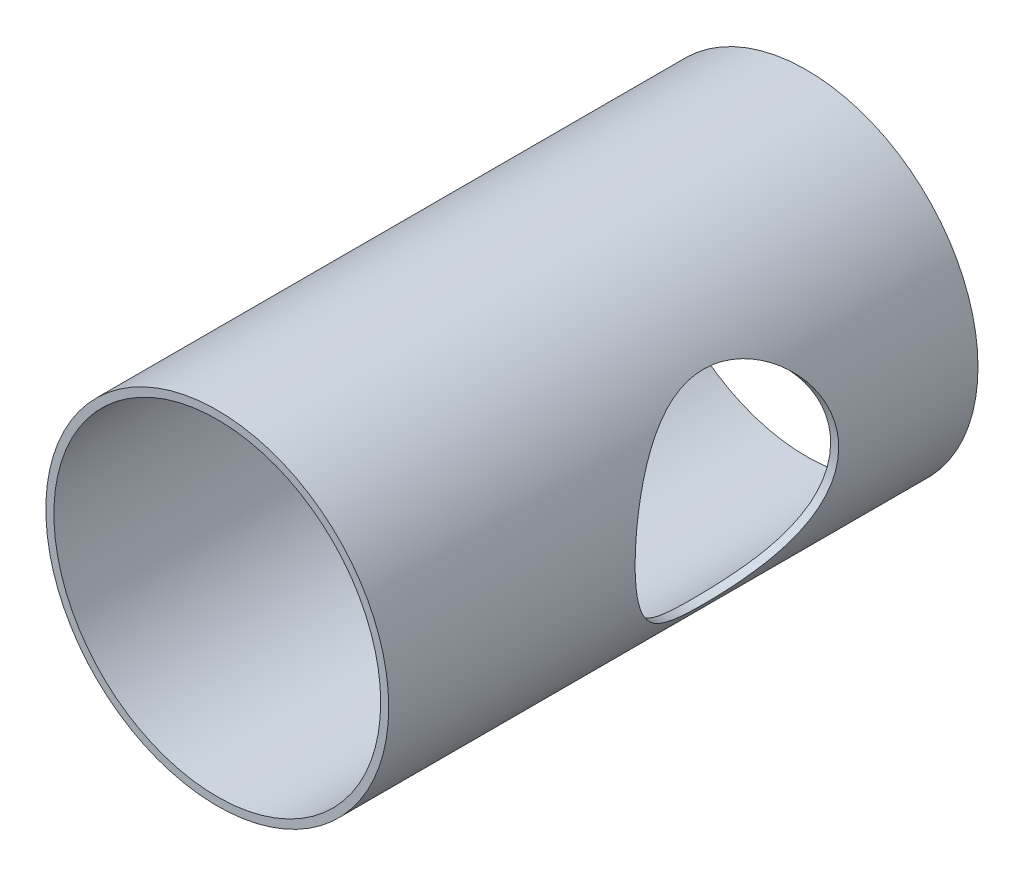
ISO-10303-21;
HEADER;
FILE_DESCRIPTION(('STEP AP214'),'2;1');
FILE_NAME('part.step','',(''),(''),'','','');
FILE_SCHEMA(('AUTOMOTIVE_DESIGN { 1 0 10303 214 1 1 1 1 }'));
ENDSEC;
DATA;
#1=APPLICATION_CONTEXT('core data for automotive mechanical design processes');
#2=APPLICATION_PROTOCOL_DEFINITION('international standard','automotive_design',2000,#1);
#3=PRODUCT_CONTEXT('',#1,'mechanical');
#4=PRODUCT('Part','Part','',(#3));
#5=PRODUCT_RELATED_PRODUCT_CATEGORY('part','',(#4));
#6=PRODUCT_DEFINITION_FORMATION('','',#4);
#7=PRODUCT_DEFINITION_CONTEXT('part definition',#1,'design');
#8=PRODUCT_DEFINITION('design','',#6,#7);
#9=PRODUCT_DEFINITION_SHAPE('','',#8);
#10=(LENGTH_UNIT() NAMED_UNIT(*) SI_UNIT(.MILLI.,.METRE.));
#11=(NAMED_UNIT(*) PLANE_ANGLE_UNIT() SI_UNIT($,.RADIAN.));
#12=(NAMED_UNIT(*) SI_UNIT($,.STERADIAN.) SOLID_ANGLE_UNIT());
#13=UNCERTAINTY_MEASURE_WITH_UNIT(LENGTH_MEASURE(1.E-05),#10,'distance_accuracy_value','');
#14=(GEOMETRIC_REPRESENTATION_CONTEXT(3) GLOBAL_UNCERTAINTY_ASSIGNED_CONTEXT((#13)) GLOBAL_UNIT_ASSIGNED_CONTEXT((#10,
#11,#12)) REPRESENTATION_CONTEXT('',''));
#15=CARTESIAN_POINT('',(0.,0.,0.));
#16=DIRECTION('',(0.,0.,1.));
#17=DIRECTION('',(1.,0.,0.));
#18=AXIS2_PLACEMENT_3D('',#15,#16,#17);
#19=CARTESIAN_POINT('',(0.,0.,220.));
#20=DIRECTION('',(0.,0.,1.));
#21=DIRECTION('',(1.,0.,0.));
#22=AXIS2_PLACEMENT_3D('',#19,#20,#21);
#23=PLANE('',#22);
#24=CARTESIAN_POINT('',(0.,0.,220.));
#25=DIRECTION('',(0.,0.,1.));
#26=DIRECTION('',(1.,0.,0.));
#27=AXIS2_PLACEMENT_3D('',#24,#25,#26);
#28=CIRCLE('',#27,64.);
#29=CARTESIAN_POINT('',(64.,0.,220.));
#30=VERTEX_POINT('',#29);
#31=EDGE_CURVE('E10',#30,#30,#28,.T.);
#32=ORIENTED_EDGE('',*,*,#31,.T.);
#33=EDGE_LOOP('',(#32));
#34=FACE_BOUND('',#33,.T.);
#35=CARTESIAN_POINT('',(0.,0.,220.));
#36=DIRECTION('',(0.,0.,1.));
#37=DIRECTION('',(1.,0.,0.));
#38=AXIS2_PLACEMENT_3D('',#35,#36,#37);
#39=CIRCLE('',#38,61.);
#40=CARTESIAN_POINT('',(61.,0.,220.));
#41=VERTEX_POINT('',#40);
#42=EDGE_CURVE('E48',#41,#41,#39,.T.);
#43=ORIENTED_EDGE('',*,*,#42,.F.);
#44=EDGE_LOOP('',(#43));
#45=FACE_BOUND('',#44,.T.);
#46=ADVANCED_FACE('F30',(#34,#45),#23,.T.);
#47=CARTESIAN_POINT('',(0.,0.,0.));
#48=DIRECTION('',(0.,0.,1.));
#49=DIRECTION('',(1.,0.,0.));
#50=AXIS2_PLACEMENT_3D('',#47,#48,#49);
#51=PLANE('',#50);
#52=CARTESIAN_POINT('',(0.,0.,0.));
#53=DIRECTION('',(0.,0.,1.));
#54=DIRECTION('',(1.,0.,0.));
#55=AXIS2_PLACEMENT_3D('',#52,#53,#54);
#56=CIRCLE('',#55,64.);
#57=CARTESIAN_POINT('',(64.,0.,0.));
#58=VERTEX_POINT('',#57);
#59=EDGE_CURVE('E43',#58,#58,#56,.T.);
#60=ORIENTED_EDGE('',*,*,#59,.F.);
#61=EDGE_LOOP('',(#60));
#62=FACE_BOUND('',#61,.T.);
#63=CARTESIAN_POINT('',(0.,0.,0.));
#64=DIRECTION('',(0.,0.,1.));
#65=DIRECTION('',(1.,0.,0.));
#66=AXIS2_PLACEMENT_3D('',#63,#64,#65);
#67=CIRCLE('',#66,61.);
#68=CARTESIAN_POINT('',(61.,0.,0.));
#69=VERTEX_POINT('',#68);
#70=EDGE_CURVE('E51',#69,#69,#67,.T.);
#71=ORIENTED_EDGE('',*,*,#70,.T.);
#72=EDGE_LOOP('',(#71));
#73=FACE_BOUND('',#72,.T.);
#74=ADVANCED_FACE('F84',(#62,#73),#51,.F.);
#75=CARTESIAN_POINT('',(0.,0.,220.));
#76=DIRECTION('',(0.,0.,-1.));
#77=DIRECTION('',(-1.,0.,0.));
#78=AXIS2_PLACEMENT_3D('',#75,#76,#77);
#79=CYLINDRICAL_SURFACE('',#78,64.);
#80=CARTESIAN_POINT('',(-64.,0.,52.));
#81=CARTESIAN_POINT('',(-63.9999912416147,0.974025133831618,52.0000096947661));
#82=CARTESIAN_POINT('',(-63.977705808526,1.94835821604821,52.0375108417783));
#83=CARTESIAN_POINT('',(-63.8890888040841,3.88969254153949,52.1870501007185));
#84=CARTESIAN_POINT('',(-63.822729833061,4.85668884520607,52.2991345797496));
#85=CARTESIAN_POINT('',(-63.6474266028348,6.77770939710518,52.5966659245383));
#86=CARTESIAN_POINT('',(-63.5383848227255,7.73169872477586,52.7822808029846));
#87=CARTESIAN_POINT('',(-63.2804214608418,9.61737539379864,53.2244112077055));
#88=CARTESIAN_POINT('',(-63.1315057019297,10.5490659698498,53.4809163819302));
#89=CARTESIAN_POINT('',(-62.7981219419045,12.3797129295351,54.0603290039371));
#90=CARTESIAN_POINT('',(-62.6138342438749,13.2788089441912,54.3829002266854));
#91=CARTESIAN_POINT('',(-62.2133002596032,15.0440880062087,55.091831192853));
#92=CARTESIAN_POINT('',(-61.9970529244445,15.9102699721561,55.4781930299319));
#93=CARTESIAN_POINT('',(-61.5372189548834,17.6051544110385,56.3109843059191));
#94=CARTESIAN_POINT('',(-61.2936439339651,18.4338725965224,56.7573882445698));
#95=CARTESIAN_POINT('',(-60.7839030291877,20.0508325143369,57.7069155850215));
#96=CARTESIAN_POINT('',(-60.5177362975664,20.8390727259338,58.2100411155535));
#97=CARTESIAN_POINT('',(-59.9470742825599,22.4302372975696,59.3097878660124));
#98=CARTESIAN_POINT('',(-59.6412025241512,23.2297708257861,59.9106011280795));
#99=CARTESIAN_POINT('',(-59.0156831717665,24.7758900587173,61.1703313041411));
#100=CARTESIAN_POINT('',(-58.6960349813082,25.522473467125,61.8292507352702));
#101=CARTESIAN_POINT('',(-58.0493495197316,26.9610020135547,63.2027148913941));
#102=CARTESIAN_POINT('',(-57.7223038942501,27.6528809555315,63.9173249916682));
#103=CARTESIAN_POINT('',(-57.0682789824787,28.9785774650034,65.3985757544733));
#104=CARTESIAN_POINT('',(-56.7412997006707,29.6123919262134,66.1652191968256));
#105=CARTESIAN_POINT('',(-56.0561704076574,30.8916361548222,67.8426428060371));
#106=CARTESIAN_POINT('',(-55.6989716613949,31.5293826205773,68.759693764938));
#107=CARTESIAN_POINT('',(-55.0051100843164,32.7248490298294,70.6522080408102));
#108=CARTESIAN_POINT('',(-54.6684505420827,33.2825561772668,71.627680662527));
#109=CARTESIAN_POINT('',(-54.0280264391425,34.3123836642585,73.6315060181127));
#110=CARTESIAN_POINT('',(-53.7242195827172,34.7846145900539,74.6597881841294));
#111=CARTESIAN_POINT('',(-53.161460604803,35.6387577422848,76.7648967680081));
#112=CARTESIAN_POINT('',(-52.9024922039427,36.0207027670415,77.8417053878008));
#113=CARTESIAN_POINT('',(-52.4962485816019,36.6092824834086,79.7761813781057));
#114=CARTESIAN_POINT('',(-52.3370490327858,36.8360117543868,80.6252767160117));
#115=CARTESIAN_POINT('',(-52.0567968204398,37.2310183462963,82.3431334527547));
#116=CARTESIAN_POINT('',(-51.9357383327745,37.399304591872,83.2118918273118));
#117=CARTESIAN_POINT('',(-51.7360256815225,37.6750941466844,84.9629377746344));
#118=CARTESIAN_POINT('',(-51.6573279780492,37.7826598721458,85.8452104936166));
#119=CARTESIAN_POINT('',(-51.5450418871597,37.9357054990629,87.6180360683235));
#120=CARTESIAN_POINT('',(-51.5114543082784,37.9811842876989,88.5085890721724));
#121=CARTESIAN_POINT('',(-51.490664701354,38.0093643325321,90.292860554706));
#122=CARTESIAN_POINT('',(-51.5035472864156,37.9919510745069,91.1865818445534));
#123=CARTESIAN_POINT('',(-51.5753856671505,37.8943690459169,92.9687061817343));
#124=CARTESIAN_POINT('',(-51.6343416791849,37.8141999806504,93.8571092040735));
#125=CARTESIAN_POINT('',(-51.796147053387,37.5922586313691,95.6226587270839));
#126=CARTESIAN_POINT('',(-51.8990240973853,37.4504474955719,96.4997977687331));
#127=CARTESIAN_POINT('',(-52.1450022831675,37.107185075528,98.2365323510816));
#128=CARTESIAN_POINT('',(-52.2881043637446,36.9057323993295,99.0961274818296));
#129=CARTESIAN_POINT('',(-52.6080765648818,36.4481443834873,100.783732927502));
#130=CARTESIAN_POINT('',(-52.7845617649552,36.192628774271,101.611985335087));
#131=CARTESIAN_POINT('',(-53.167164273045,35.6282021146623,103.242958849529));
#132=CARTESIAN_POINT('',(-53.3732810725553,35.3192919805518,104.04568039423));
#133=CARTESIAN_POINT('',(-53.8098628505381,34.6505133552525,105.62292829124));
#134=CARTESIAN_POINT('',(-54.040333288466,34.2906334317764,106.39744826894));
#135=CARTESIAN_POINT('',(-54.5202745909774,33.522303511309,107.915895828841));
#136=CARTESIAN_POINT('',(-54.7697469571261,33.1138496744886,108.659820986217));
#137=CARTESIAN_POINT('',(-55.3265838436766,32.1763129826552,110.240253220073));
#138=CARTESIAN_POINT('',(-55.6365325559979,31.6385605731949,111.070717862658));
#139=CARTESIAN_POINT('',(-56.2675298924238,30.5022537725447,112.684501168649));
#140=CARTESIAN_POINT('',(-56.5885794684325,29.9036941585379,113.467815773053));
#141=CARTESIAN_POINT('',(-57.2345934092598,28.6478670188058,114.985405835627));
#142=CARTESIAN_POINT('',(-57.5595608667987,27.9905500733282,115.719639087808));
#143=CARTESIAN_POINT('',(-58.2060725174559,26.6200544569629,117.135652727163));
#144=CARTESIAN_POINT('',(-58.5276165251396,25.9068727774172,117.817430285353));
#145=CARTESIAN_POINT('',(-59.2028541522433,24.3280530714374,119.212996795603));
#146=CARTESIAN_POINT('',(-59.555099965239,23.4547791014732,119.918882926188));
#147=CARTESIAN_POINT('',(-60.2370776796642,21.6432715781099,121.254361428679));
#148=CARTESIAN_POINT('',(-60.5668072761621,20.7050313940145,121.883945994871));
#149=CARTESIAN_POINT('',(-61.1945448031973,18.7686704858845,123.060852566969));
#150=CARTESIAN_POINT('',(-61.4925651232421,17.7705733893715,123.60820673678));
#151=CARTESIAN_POINT('',(-62.0484023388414,15.7201620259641,124.614741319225));
#152=CARTESIAN_POINT('',(-62.3062242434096,14.6678545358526,125.07393271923));
#153=CARTESIAN_POINT('',(-62.7586606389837,12.5861290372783,125.871299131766));
#154=CARTESIAN_POINT('',(-62.956283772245,11.5596290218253,126.215378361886));
#155=CARTESIAN_POINT('',(-63.3038085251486,9.47341861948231,126.81619636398));
#156=CARTESIAN_POINT('',(-63.4537116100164,8.41370925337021,127.072937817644));
#157=CARTESIAN_POINT('',(-63.7011266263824,6.27121887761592,127.494835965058));
#158=CARTESIAN_POINT('',(-63.7986886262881,5.18846095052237,127.660080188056));
#159=CARTESIAN_POINT('',(-63.938533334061,3.00922933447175,127.896507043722));
#160=CARTESIAN_POINT('',(-63.9808234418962,1.91275750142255,127.967702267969));
#161=CARTESIAN_POINT('',(-64.0069407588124,-0.137024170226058,128.011688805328));
#162=CARTESIAN_POINT('',(-63.9977835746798,-1.09001638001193,127.996288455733));
#163=CARTESIAN_POINT('',(-63.9371509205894,-2.99073548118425,127.894076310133));
#164=CARTESIAN_POINT('',(-63.8856799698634,-3.93846292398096,127.807272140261));
#165=CARTESIAN_POINT('',(-63.741671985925,-5.82161048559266,127.563418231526));
#166=CARTESIAN_POINT('',(-63.6491359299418,-6.75703089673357,127.406370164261));
#167=CARTESIAN_POINT('',(-63.4251856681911,-8.6090613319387,127.024021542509));
#168=CARTESIAN_POINT('',(-63.293770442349,-9.52567086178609,126.798719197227));
#169=CARTESIAN_POINT('',(-62.9982084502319,-11.3150689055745,126.287968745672));
#170=CARTESIAN_POINT('',(-62.83481114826,-12.1883740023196,126.003890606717));
#171=CARTESIAN_POINT('',(-62.4770256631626,-13.9065211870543,125.375773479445));
#172=CARTESIAN_POINT('',(-62.2826383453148,-14.7513640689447,125.031736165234));
#173=CARTESIAN_POINT('',(-61.8666745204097,-16.4086762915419,124.28674538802));
#174=CARTESIAN_POINT('',(-61.6450954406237,-17.2211425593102,123.885786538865));
#175=CARTESIAN_POINT('',(-61.1788956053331,-18.810332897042,123.030076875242));
#176=CARTESIAN_POINT('',(-60.9342734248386,-19.5870547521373,122.575322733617));
#177=CARTESIAN_POINT('',(-60.3999052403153,-21.1808735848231,121.565029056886));
#178=CARTESIAN_POINT('',(-60.1081125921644,-21.993760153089,121.003926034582));
#179=CARTESIAN_POINT('',(-59.5078635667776,-23.569583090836,119.823549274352));
#180=CARTESIAN_POINT('',(-59.1994062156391,-24.3325165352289,119.204272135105));
#181=CARTESIAN_POINT('',(-58.5718351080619,-25.806637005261,117.910220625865));
#182=CARTESIAN_POINT('',(-58.25271030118,-26.5177677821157,117.235387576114));
#183=CARTESIAN_POINT('',(-57.6107248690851,-27.8850298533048,115.833771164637));
#184=CARTESIAN_POINT('',(-57.2878640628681,-28.5411584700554,115.10698527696));
#185=CARTESIAN_POINT('',(-56.6046674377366,-29.8754417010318,113.509021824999));
#186=CARTESIAN_POINT('',(-56.2447554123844,-30.5458899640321,112.631207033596));
#187=CARTESIAN_POINT('',(-55.5393957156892,-31.8103732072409,110.816421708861));
#188=CARTESIAN_POINT('',(-55.1939503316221,-32.4043961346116,109.879441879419));
#189=CARTESIAN_POINT('',(-54.5290669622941,-33.5111519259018,107.950976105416));
#190=CARTESIAN_POINT('',(-54.2096060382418,-34.0239568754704,106.959539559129));
#191=CARTESIAN_POINT('',(-53.6082401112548,-34.9638105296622,104.926004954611));
#192=CARTESIAN_POINT('',(-53.3263235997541,-35.3908855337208,103.883922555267));
#193=CARTESIAN_POINT('',(-52.8676825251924,-36.0712928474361,101.985300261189));
#194=CARTESIAN_POINT('',(-52.681392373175,-36.3422261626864,101.13734673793));
#195=CARTESIAN_POINT('',(-52.3448701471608,-36.8252815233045,99.41784285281));
#196=CARTESIAN_POINT('',(-52.1946331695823,-37.0374115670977,98.5462957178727));
#197=CARTESIAN_POINT('',(-51.9353913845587,-37.4000654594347,96.7854365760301));
#198=CARTESIAN_POINT('',(-51.826339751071,-37.5506592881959,95.8961459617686));
#199=CARTESIAN_POINT('',(-51.6532111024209,-37.7884577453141,94.1047262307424));
#200=CARTESIAN_POINT('',(-51.5891344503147,-37.8756618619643,93.2025970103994));
#201=CARTESIAN_POINT('',(-51.5083177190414,-37.9854965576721,91.3892057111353));
#202=CARTESIAN_POINT('',(-51.4917383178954,-38.0079079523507,90.4779230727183));
#203=CARTESIAN_POINT('',(-51.5070441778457,-37.9871629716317,88.6565162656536));
#204=CARTESIAN_POINT('',(-51.5389295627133,-37.9440064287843,87.7463920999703));
#205=CARTESIAN_POINT('',(-51.6499115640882,-37.7927948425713,85.9340403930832));
#206=CARTESIAN_POINT('',(-51.7290317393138,-37.6847074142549,85.0318170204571));
#207=CARTESIAN_POINT('',(-51.9314531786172,-37.4052643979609,83.2423084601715));
#208=CARTESIAN_POINT('',(-52.0547547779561,-37.2339083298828,82.3550233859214));
#209=CARTESIAN_POINT('',(-52.3352218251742,-36.8385757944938,80.6370830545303));
#210=CARTESIAN_POINT('',(-52.4907895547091,-36.6170478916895,79.8055982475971));
#211=CARTESIAN_POINT('',(-52.8337880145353,-36.1203796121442,78.1656332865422));
#212=CARTESIAN_POINT('',(-53.0212175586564,-35.8452412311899,77.3571522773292));
#213=CARTESIAN_POINT('',(-53.4229139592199,-35.2437654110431,75.7662196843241));
#214=CARTESIAN_POINT('',(-53.6371864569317,-34.9174172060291,74.9837736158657));
#215=CARTESIAN_POINT('',(-54.0874127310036,-34.215865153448,73.4474242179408));
#216=CARTESIAN_POINT('',(-54.3233692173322,-33.840655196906,72.6935244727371));
#217=CARTESIAN_POINT('',(-54.7085710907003,-33.2121223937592,71.5286791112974));
#218=CARTESIAN_POINT('',(-54.8523183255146,-32.974303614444,71.107447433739));
#219=CARTESIAN_POINT('',(-55.1443527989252,-32.4835633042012,70.2756176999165));
#220=CARTESIAN_POINT('',(-55.2926391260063,-32.2306447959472,69.865017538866));
#221=CARTESIAN_POINT('',(-55.7429954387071,-31.4496345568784,68.6493950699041));
#222=CARTESIAN_POINT('',(-56.0505634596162,-30.899286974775,67.8605486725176));
#223=CARTESIAN_POINT('',(-56.6733177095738,-29.741677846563,66.3281712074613));
#224=CARTESIAN_POINT('',(-56.9885091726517,-29.134376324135,65.5846725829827));
#225=CARTESIAN_POINT('',(-57.6196125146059,-27.8654345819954,64.1458380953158));
#226=CARTESIAN_POINT('',(-57.9355244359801,-27.2037910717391,63.4505051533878));
#227=CARTESIAN_POINT('',(-58.6101175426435,-25.7218826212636,62.0068957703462));
#228=CARTESIAN_POINT('',(-58.967852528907,-24.8929152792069,61.2670761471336));
#229=CARTESIAN_POINT('',(-59.6663001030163,-23.1688973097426,59.8596517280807));
#230=CARTESIAN_POINT('',(-60.0070106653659,-22.2738388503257,59.1920555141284));
#231=CARTESIAN_POINT('',(-60.6624794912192,-20.4212913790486,57.934055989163));
#232=CARTESIAN_POINT('',(-60.9772259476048,-19.4637743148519,57.3436877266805));
#233=CARTESIAN_POINT('',(-61.5718639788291,-17.4918823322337,56.2463774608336));
#234=CARTESIAN_POINT('',(-61.8517602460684,-16.4775150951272,55.7394242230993));
#235=CARTESIAN_POINT('',(-62.3589769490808,-14.4367927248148,54.8321418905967));
#236=CARTESIAN_POINT('',(-62.5878685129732,-13.4122945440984,54.4285421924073));
#237=CARTESIAN_POINT('',(-62.8963803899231,-11.8460662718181,53.8893897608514));
#238=CARTESIAN_POINT('',(-62.9934345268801,-11.3189331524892,53.7206775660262));
#239=CARTESIAN_POINT('',(-63.175215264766,-10.2558625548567,53.4059515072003));
#240=CARTESIAN_POINT('',(-63.2599434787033,-9.7199262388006,53.2599346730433));
#241=CARTESIAN_POINT('',(-63.416160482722,-8.6421185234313,52.9916055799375));
#242=CARTESIAN_POINT('',(-63.4876909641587,-8.10027174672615,52.8692186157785));
#243=CARTESIAN_POINT('',(-63.6172740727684,-7.01024985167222,52.648084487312));
#244=CARTESIAN_POINT('',(-63.675328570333,-6.46207562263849,52.5493340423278));
#245=CARTESIAN_POINT('',(-63.7774635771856,-5.36102777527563,52.3759416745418));
#246=CARTESIAN_POINT('',(-63.8215537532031,-4.80815768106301,52.3012830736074));
#247=CARTESIAN_POINT('',(-63.8954445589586,-3.6988007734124,52.1763251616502));
#248=CARTESIAN_POINT('',(-63.9252475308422,-3.14231456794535,52.1260218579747));
#249=CARTESIAN_POINT('',(-63.9651613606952,-2.15482080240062,52.0586977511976));
#250=CARTESIAN_POINT('',(-63.9782189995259,-1.72426527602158,52.0366928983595));
#251=CARTESIAN_POINT('',(-63.9956403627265,-0.862493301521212,52.007341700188));
#252=CARTESIAN_POINT('',(-64.0000038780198,-0.431276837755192,51.9999957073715));
#253=CARTESIAN_POINT('',(-64.,0.,52.));
#254=B_SPLINE_CURVE_WITH_KNOTS('',3,(#80,#81,#82,#83,#84,#85,#86,#87,#88,#89,#90,#91,#92,#93,
#94,#95,#96,#97,#98,#99,#100,#101,#102,#103,#104,#105,#106,#107,#108,#109,#110,#111,#112,#113,
#114,#115,#116,#117,#118,#119,#120,#121,#122,#123,#124,#125,#126,#127,#128,#129,#130,#131,#132,
#133,#134,#135,#136,#137,#138,#139,#140,#141,#142,#143,#144,#145,#146,#147,#148,#149,#150,#151,
#152,#153,#154,#155,#156,#157,#158,#159,#160,#161,#162,#163,#164,#165,#166,#167,#168,#169,#170,
#171,#172,#173,#174,#175,#176,#177,#178,#179,#180,#181,#182,#183,#184,#185,#186,#187,#188,#189,
#190,#191,#192,#193,#194,#195,#196,#197,#198,#199,#200,#201,#202,#203,#204,#205,#206,#207,#208,
#209,#210,#211,#212,#213,#214,#215,#216,#217,#218,#219,#220,#221,#222,#223,#224,#225,#226,#227,
#228,#229,#230,#231,#232,#233,#234,#235,#236,#237,#238,#239,#240,#241,#242,#243,#244,#245,#246,
#247,#248,#249,#250,#251,#252,#253),.UNSPECIFIED.,.T.,.F.,(4,2,2,2,2,2,2,2,2,2,2,2,2,2,2,2,2,2,
2,2,2,2,2,2,2,2,2,2,2,2,2,2,2,2,2,2,2,2,2,2,2,2,2,2,2,2,2,2,2,2,2,2,2,2,2,2,2,2,2,2,2,2,2,2,2,2,
2,2,2,2,2,2,2,2,2,2,2,2,2,2,2,2,2,2,2,2,4),(0.,2.92164036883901,5.84509876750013,
8.77527598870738,11.7050255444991,14.6202197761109,17.5355097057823,20.4495653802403,
23.3637304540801,26.4980913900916,29.6325881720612,32.7708216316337,35.9092228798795,
39.4231183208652,42.9375749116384,46.4474516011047,49.9560512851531,52.6328088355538,
55.309157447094,57.9827499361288,60.6563903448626,63.3349013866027,66.0134250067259,
68.6936393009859,71.3739161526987,74.0249891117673,76.6760165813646,79.3276396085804,
81.9794723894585,85.0867416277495,88.1942779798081,91.3044530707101,94.4147957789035,
97.9408981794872,101.467360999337,104.992440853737,108.517081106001,111.813867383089,
115.110552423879,118.404078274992,121.697163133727,124.553096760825,127.408725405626,
130.264286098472,133.119921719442,135.915279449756,138.710559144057,141.506103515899,
144.301820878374,147.388486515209,150.475332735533,153.565482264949,156.655782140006,
160.136856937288,163.618480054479,167.096995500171,170.574442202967,173.300180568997,
176.02554799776,178.74780740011,181.470088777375,184.201568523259,186.933055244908,
189.66590545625,192.398776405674,195.019473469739,197.640072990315,200.261224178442,
202.882703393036,204.396284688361,205.909564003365,208.936115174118,211.964806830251,
214.99368201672,218.491243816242,221.989220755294,225.488779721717,228.987866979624,
232.356497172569,234.04170521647,235.726692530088,237.406262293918,239.085598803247,
240.763770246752,242.441666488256,243.73527327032,245.028911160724),.UNSPECIFIED.);
#255=CARTESIAN_POINT('',(-64.,0.,52.));
#256=VERTEX_POINT('',#255);
#257=EDGE_CURVE('E74',#256,#256,#254,.T.);
#258=ORIENTED_EDGE('',*,*,#257,.T.);
#259=EDGE_LOOP('',(#258));
#260=FACE_BOUND('',#259,.T.);
#261=CARTESIAN_POINT('',(64.,0.,52.));
#262=CARTESIAN_POINT('',(63.9999912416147,-0.974025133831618,52.0000096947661));
#263=CARTESIAN_POINT('',(63.977705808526,-1.94835821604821,52.0375108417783));
#264=CARTESIAN_POINT('',(63.8890888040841,-3.88969254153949,52.1870501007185));
#265=CARTESIAN_POINT('',(63.822729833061,-4.85668884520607,52.2991345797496));
#266=CARTESIAN_POINT('',(63.6474266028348,-6.77770939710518,52.5966659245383));
#267=CARTESIAN_POINT('',(63.5383848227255,-7.73169872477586,52.7822808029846));
#268=CARTESIAN_POINT('',(63.2804214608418,-9.61737539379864,53.2244112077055));
#269=CARTESIAN_POINT('',(63.1315057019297,-10.5490659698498,53.4809163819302));
#270=CARTESIAN_POINT('',(62.7981219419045,-12.3797129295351,54.0603290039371));
#271=CARTESIAN_POINT('',(62.6138342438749,-13.2788089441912,54.3829002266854));
#272=CARTESIAN_POINT('',(62.2133002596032,-15.0440880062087,55.091831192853));
#273=CARTESIAN_POINT('',(61.9970529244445,-15.9102699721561,55.4781930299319));
#274=CARTESIAN_POINT('',(61.5372189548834,-17.6051544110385,56.3109843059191));
#275=CARTESIAN_POINT('',(61.2936439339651,-18.4338725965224,56.7573882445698));
#276=CARTESIAN_POINT('',(60.7839030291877,-20.0508325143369,57.7069155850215));
#277=CARTESIAN_POINT('',(60.5177362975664,-20.8390727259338,58.2100411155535));
#278=CARTESIAN_POINT('',(59.9470742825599,-22.4302372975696,59.3097878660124));
#279=CARTESIAN_POINT('',(59.6412025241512,-23.2297708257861,59.9106011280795));
#280=CARTESIAN_POINT('',(59.0156831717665,-24.7758900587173,61.1703313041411));
#281=CARTESIAN_POINT('',(58.6960349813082,-25.522473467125,61.8292507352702));
#282=CARTESIAN_POINT('',(58.0493495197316,-26.9610020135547,63.2027148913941));
#283=CARTESIAN_POINT('',(57.7223038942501,-27.6528809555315,63.9173249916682));
#284=CARTESIAN_POINT('',(57.0682789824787,-28.9785774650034,65.3985757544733));
#285=CARTESIAN_POINT('',(56.7412997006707,-29.6123919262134,66.1652191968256));
#286=CARTESIAN_POINT('',(56.0561704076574,-30.8916361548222,67.8426428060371));
#287=CARTESIAN_POINT('',(55.6989716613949,-31.5293826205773,68.759693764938));
#288=CARTESIAN_POINT('',(55.0051100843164,-32.7248490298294,70.6522080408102));
#289=CARTESIAN_POINT('',(54.6684505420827,-33.2825561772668,71.627680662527));
#290=CARTESIAN_POINT('',(54.0280264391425,-34.3123836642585,73.6315060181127));
#291=CARTESIAN_POINT('',(53.7242195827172,-34.7846145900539,74.6597881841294));
#292=CARTESIAN_POINT('',(53.161460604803,-35.6387577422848,76.7648967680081));
#293=CARTESIAN_POINT('',(52.9024922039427,-36.0207027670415,77.8417053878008));
#294=CARTESIAN_POINT('',(52.4962485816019,-36.6092824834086,79.7761813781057));
#295=CARTESIAN_POINT('',(52.3370490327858,-36.8360117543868,80.6252767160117));
#296=CARTESIAN_POINT('',(52.0567968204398,-37.2310183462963,82.3431334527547));
#297=CARTESIAN_POINT('',(51.9357383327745,-37.399304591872,83.2118918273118));
#298=CARTESIAN_POINT('',(51.7360256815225,-37.6750941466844,84.9629377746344));
#299=CARTESIAN_POINT('',(51.6573279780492,-37.7826598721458,85.8452104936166));
#300=CARTESIAN_POINT('',(51.5450418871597,-37.9357054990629,87.6180360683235));
#301=CARTESIAN_POINT('',(51.5114543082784,-37.9811842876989,88.5085890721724));
#302=CARTESIAN_POINT('',(51.490664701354,-38.0093643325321,90.292860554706));
#303=CARTESIAN_POINT('',(51.5035472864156,-37.9919510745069,91.1865818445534));
#304=CARTESIAN_POINT('',(51.5753856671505,-37.8943690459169,92.9687061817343));
#305=CARTESIAN_POINT('',(51.6343416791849,-37.8141999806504,93.8571092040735));
#306=CARTESIAN_POINT('',(51.796147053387,-37.5922586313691,95.6226587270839));
#307=CARTESIAN_POINT('',(51.8990240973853,-37.4504474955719,96.4997977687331));
#308=CARTESIAN_POINT('',(52.1450022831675,-37.107185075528,98.2365323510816));
#309=CARTESIAN_POINT('',(52.2881043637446,-36.9057323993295,99.0961274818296));
#310=CARTESIAN_POINT('',(52.6080765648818,-36.4481443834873,100.783732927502));
#311=CARTESIAN_POINT('',(52.7845617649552,-36.192628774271,101.611985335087));
#312=CARTESIAN_POINT('',(53.167164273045,-35.6282021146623,103.242958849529));
#313=CARTESIAN_POINT('',(53.3732810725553,-35.3192919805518,104.04568039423));
#314=CARTESIAN_POINT('',(53.8098628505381,-34.6505133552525,105.62292829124));
#315=CARTESIAN_POINT('',(54.040333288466,-34.2906334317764,106.39744826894));
#316=CARTESIAN_POINT('',(54.5202745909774,-33.522303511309,107.915895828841));
#317=CARTESIAN_POINT('',(54.7697469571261,-33.1138496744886,108.659820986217));
#318=CARTESIAN_POINT('',(55.3265838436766,-32.1763129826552,110.240253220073));
#319=CARTESIAN_POINT('',(55.6365325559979,-31.6385605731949,111.070717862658));
#320=CARTESIAN_POINT('',(56.2675298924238,-30.5022537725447,112.684501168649));
#321=CARTESIAN_POINT('',(56.5885794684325,-29.9036941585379,113.467815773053));
#322=CARTESIAN_POINT('',(57.2345934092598,-28.6478670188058,114.985405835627));
#323=CARTESIAN_POINT('',(57.5595608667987,-27.9905500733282,115.719639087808));
#324=CARTESIAN_POINT('',(58.2060725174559,-26.6200544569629,117.135652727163));
#325=CARTESIAN_POINT('',(58.5276165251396,-25.9068727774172,117.817430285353));
#326=CARTESIAN_POINT('',(59.2028541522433,-24.3280530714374,119.212996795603));
#327=CARTESIAN_POINT('',(59.555099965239,-23.4547791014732,119.918882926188));
#328=CARTESIAN_POINT('',(60.2370776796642,-21.6432715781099,121.254361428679));
#329=CARTESIAN_POINT('',(60.5668072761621,-20.7050313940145,121.883945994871));
#330=CARTESIAN_POINT('',(61.1945448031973,-18.7686704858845,123.060852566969));
#331=CARTESIAN_POINT('',(61.4925651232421,-17.7705733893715,123.60820673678));
#332=CARTESIAN_POINT('',(62.0484023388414,-15.7201620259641,124.614741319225));
#333=CARTESIAN_POINT('',(62.3062242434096,-14.6678545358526,125.07393271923));
#334=CARTESIAN_POINT('',(62.7586606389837,-12.5861290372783,125.871299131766));
#335=CARTESIAN_POINT('',(62.956283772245,-11.5596290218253,126.215378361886));
#336=CARTESIAN_POINT('',(63.3038085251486,-9.47341861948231,126.81619636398));
#337=CARTESIAN_POINT('',(63.4537116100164,-8.41370925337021,127.072937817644));
#338=CARTESIAN_POINT('',(63.7011266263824,-6.27121887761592,127.494835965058));
#339=CARTESIAN_POINT('',(63.7986886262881,-5.18846095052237,127.660080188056));
#340=CARTESIAN_POINT('',(63.938533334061,-3.00922933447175,127.896507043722));
#341=CARTESIAN_POINT('',(63.9808234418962,-1.91275750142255,127.967702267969));
#342=CARTESIAN_POINT('',(64.0069407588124,0.137024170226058,128.011688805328));
#343=CARTESIAN_POINT('',(63.9977835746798,1.09001638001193,127.996288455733));
#344=CARTESIAN_POINT('',(63.9371509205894,2.99073548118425,127.894076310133));
#345=CARTESIAN_POINT('',(63.8856799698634,3.93846292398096,127.807272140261));
#346=CARTESIAN_POINT('',(63.741671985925,5.82161048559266,127.563418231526));
#347=CARTESIAN_POINT('',(63.6491359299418,6.75703089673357,127.406370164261));
#348=CARTESIAN_POINT('',(63.4251856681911,8.6090613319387,127.024021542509));
#349=CARTESIAN_POINT('',(63.293770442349,9.52567086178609,126.798719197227));
#350=CARTESIAN_POINT('',(62.9982084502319,11.3150689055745,126.287968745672));
#351=CARTESIAN_POINT('',(62.83481114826,12.1883740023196,126.003890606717));
#352=CARTESIAN_POINT('',(62.4770256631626,13.9065211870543,125.375773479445));
#353=CARTESIAN_POINT('',(62.2826383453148,14.7513640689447,125.031736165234));
#354=CARTESIAN_POINT('',(61.8666745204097,16.4086762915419,124.28674538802));
#355=CARTESIAN_POINT('',(61.6450954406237,17.2211425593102,123.885786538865));
#356=CARTESIAN_POINT('',(61.1788956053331,18.810332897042,123.030076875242));
#357=CARTESIAN_POINT('',(60.9342734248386,19.5870547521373,122.575322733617));
#358=CARTESIAN_POINT('',(60.3999052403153,21.1808735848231,121.565029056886));
#359=CARTESIAN_POINT('',(60.1081125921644,21.993760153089,121.003926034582));
#360=CARTESIAN_POINT('',(59.5078635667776,23.569583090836,119.823549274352));
#361=CARTESIAN_POINT('',(59.1994062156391,24.3325165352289,119.204272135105));
#362=CARTESIAN_POINT('',(58.5718351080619,25.806637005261,117.910220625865));
#363=CARTESIAN_POINT('',(58.25271030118,26.5177677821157,117.235387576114));
#364=CARTESIAN_POINT('',(57.6107248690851,27.8850298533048,115.833771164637));
#365=CARTESIAN_POINT('',(57.2878640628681,28.5411584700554,115.10698527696));
#366=CARTESIAN_POINT('',(56.6046674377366,29.8754417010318,113.509021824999));
#367=CARTESIAN_POINT('',(56.2447554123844,30.5458899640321,112.631207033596));
#368=CARTESIAN_POINT('',(55.5393957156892,31.8103732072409,110.816421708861));
#369=CARTESIAN_POINT('',(55.1939503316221,32.4043961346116,109.879441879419));
#370=CARTESIAN_POINT('',(54.5290669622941,33.5111519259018,107.950976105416));
#371=CARTESIAN_POINT('',(54.2096060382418,34.0239568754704,106.959539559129));
#372=CARTESIAN_POINT('',(53.6082401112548,34.9638105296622,104.926004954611));
#373=CARTESIAN_POINT('',(53.3263235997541,35.3908855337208,103.883922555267));
#374=CARTESIAN_POINT('',(52.8676825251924,36.0712928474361,101.985300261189));
#375=CARTESIAN_POINT('',(52.681392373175,36.3422261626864,101.13734673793));
#376=CARTESIAN_POINT('',(52.3448701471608,36.8252815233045,99.41784285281));
#377=CARTESIAN_POINT('',(52.1946331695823,37.0374115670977,98.5462957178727));
#378=CARTESIAN_POINT('',(51.9353913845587,37.4000654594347,96.7854365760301));
#379=CARTESIAN_POINT('',(51.826339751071,37.5506592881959,95.8961459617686));
#380=CARTESIAN_POINT('',(51.6532111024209,37.7884577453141,94.1047262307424));
#381=CARTESIAN_POINT('',(51.5891344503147,37.8756618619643,93.2025970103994));
#382=CARTESIAN_POINT('',(51.5083177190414,37.9854965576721,91.3892057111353));
#383=CARTESIAN_POINT('',(51.4917383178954,38.0079079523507,90.4779230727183));
#384=CARTESIAN_POINT('',(51.5070441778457,37.9871629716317,88.6565162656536));
#385=CARTESIAN_POINT('',(51.5389295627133,37.9440064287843,87.7463920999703));
#386=CARTESIAN_POINT('',(51.6499115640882,37.7927948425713,85.9340403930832));
#387=CARTESIAN_POINT('',(51.7290317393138,37.6847074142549,85.0318170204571));
#388=CARTESIAN_POINT('',(51.9314531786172,37.4052643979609,83.2423084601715));
#389=CARTESIAN_POINT('',(52.0547547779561,37.2339083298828,82.3550233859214));
#390=CARTESIAN_POINT('',(52.3352218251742,36.8385757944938,80.6370830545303));
#391=CARTESIAN_POINT('',(52.4907895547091,36.6170478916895,79.8055982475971));
#392=CARTESIAN_POINT('',(52.8337880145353,36.1203796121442,78.1656332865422));
#393=CARTESIAN_POINT('',(53.0212175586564,35.8452412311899,77.3571522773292));
#394=CARTESIAN_POINT('',(53.4229139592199,35.2437654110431,75.7662196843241));
#395=CARTESIAN_POINT('',(53.6371864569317,34.9174172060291,74.9837736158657));
#396=CARTESIAN_POINT('',(54.0874127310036,34.215865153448,73.4474242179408));
#397=CARTESIAN_POINT('',(54.3233692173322,33.840655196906,72.6935244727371));
#398=CARTESIAN_POINT('',(54.7085710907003,33.2121223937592,71.5286791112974));
#399=CARTESIAN_POINT('',(54.8523183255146,32.974303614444,71.107447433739));
#400=CARTESIAN_POINT('',(55.1443527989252,32.4835633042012,70.2756176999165));
#401=CARTESIAN_POINT('',(55.2926391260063,32.2306447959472,69.865017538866));
#402=CARTESIAN_POINT('',(55.7429954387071,31.4496345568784,68.6493950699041));
#403=CARTESIAN_POINT('',(56.0505634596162,30.899286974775,67.8605486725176));
#404=CARTESIAN_POINT('',(56.6733177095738,29.741677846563,66.3281712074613));
#405=CARTESIAN_POINT('',(56.9885091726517,29.134376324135,65.5846725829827));
#406=CARTESIAN_POINT('',(57.6196125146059,27.8654345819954,64.1458380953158));
#407=CARTESIAN_POINT('',(57.9355244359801,27.2037910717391,63.4505051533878));
#408=CARTESIAN_POINT('',(58.6101175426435,25.7218826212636,62.0068957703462));
#409=CARTESIAN_POINT('',(58.967852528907,24.8929152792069,61.2670761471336));
#410=CARTESIAN_POINT('',(59.6663001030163,23.1688973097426,59.8596517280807));
#411=CARTESIAN_POINT('',(60.0070106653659,22.2738388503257,59.1920555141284));
#412=CARTESIAN_POINT('',(60.6624794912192,20.4212913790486,57.934055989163));
#413=CARTESIAN_POINT('',(60.9772259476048,19.4637743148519,57.3436877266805));
#414=CARTESIAN_POINT('',(61.5718639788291,17.4918823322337,56.2463774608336));
#415=CARTESIAN_POINT('',(61.8517602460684,16.4775150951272,55.7394242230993));
#416=CARTESIAN_POINT('',(62.3589769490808,14.4367927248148,54.8321418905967));
#417=CARTESIAN_POINT('',(62.5878685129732,13.4122945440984,54.4285421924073));
#418=CARTESIAN_POINT('',(62.8963803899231,11.8460662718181,53.8893897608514));
#419=CARTESIAN_POINT('',(62.9934345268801,11.3189331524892,53.7206775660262));
#420=CARTESIAN_POINT('',(63.175215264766,10.2558625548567,53.4059515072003));
#421=CARTESIAN_POINT('',(63.2599434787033,9.7199262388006,53.2599346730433));
#422=CARTESIAN_POINT('',(63.416160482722,8.6421185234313,52.9916055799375));
#423=CARTESIAN_POINT('',(63.4876909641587,8.10027174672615,52.8692186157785));
#424=CARTESIAN_POINT('',(63.6172740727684,7.01024985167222,52.648084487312));
#425=CARTESIAN_POINT('',(63.675328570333,6.46207562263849,52.5493340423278));
#426=CARTESIAN_POINT('',(63.7774635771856,5.36102777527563,52.3759416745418));
#427=CARTESIAN_POINT('',(63.8215537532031,4.80815768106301,52.3012830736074));
#428=CARTESIAN_POINT('',(63.8954445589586,3.6988007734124,52.1763251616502));
#429=CARTESIAN_POINT('',(63.9252475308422,3.14231456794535,52.1260218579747));
#430=CARTESIAN_POINT('',(63.9651613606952,2.15482080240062,52.0586977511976));
#431=CARTESIAN_POINT('',(63.9782189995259,1.72426527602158,52.0366928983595));
#432=CARTESIAN_POINT('',(63.9956403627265,0.862493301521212,52.007341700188));
#433=CARTESIAN_POINT('',(64.0000038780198,0.431276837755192,51.9999957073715));
#434=CARTESIAN_POINT('',(64.,0.,52.));
#435=B_SPLINE_CURVE_WITH_KNOTS('',3,(#261,#262,#263,#264,#265,#266,#267,#268,#269,#270,#271,
#272,#273,#274,#275,#276,#277,#278,#279,#280,#281,#282,#283,#284,#285,#286,#287,#288,#289,#290,
#291,#292,#293,#294,#295,#296,#297,#298,#299,#300,#301,#302,#303,#304,#305,#306,#307,#308,#309,
#310,#311,#312,#313,#314,#315,#316,#317,#318,#319,#320,#321,#322,#323,#324,#325,#326,#327,#328,
#329,#330,#331,#332,#333,#334,#335,#336,#337,#338,#339,#340,#341,#342,#343,#344,#345,#346,#347,
#348,#349,#350,#351,#352,#353,#354,#355,#356,#357,#358,#359,#360,#361,#362,#363,#364,#365,#366,
#367,#368,#369,#370,#371,#372,#373,#374,#375,#376,#377,#378,#379,#380,#381,#382,#383,#384,#385,
#386,#387,#388,#389,#390,#391,#392,#393,#394,#395,#396,#397,#398,#399,#400,#401,#402,#403,#404,
#405,#406,#407,#408,#409,#410,#411,#412,#413,#414,#415,#416,#417,#418,#419,#420,#421,#422,#423,
#424,#425,#426,#427,#428,#429,#430,#431,#432,#433,#434),.UNSPECIFIED.,.T.,.F.,(4,2,2,2,2,2,2,2,
2,2,2,2,2,2,2,2,2,2,2,2,2,2,2,2,2,2,2,2,2,2,2,2,2,2,2,2,2,2,2,2,2,2,2,2,2,2,2,2,2,2,2,2,2,2,2,2,
2,2,2,2,2,2,2,2,2,2,2,2,2,2,2,2,2,2,2,2,2,2,2,2,2,2,2,2,2,2,4),(0.,2.92164036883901,
5.84509876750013,8.77527598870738,11.7050255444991,14.6202197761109,17.5355097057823,
20.4495653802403,23.3637304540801,26.4980913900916,29.6325881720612,32.7708216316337,
35.9092228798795,39.4231183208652,42.9375749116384,46.4474516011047,49.9560512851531,
52.6328088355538,55.309157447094,57.9827499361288,60.6563903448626,63.3349013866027,
66.0134250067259,68.6936393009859,71.3739161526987,74.0249891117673,76.6760165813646,
79.3276396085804,81.9794723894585,85.0867416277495,88.1942779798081,91.3044530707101,
94.4147957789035,97.9408981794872,101.467360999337,104.992440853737,108.517081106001,
111.813867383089,115.110552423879,118.404078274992,121.697163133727,124.553096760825,
127.408725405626,130.264286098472,133.119921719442,135.915279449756,138.710559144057,
141.506103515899,144.301820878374,147.388486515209,150.475332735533,153.565482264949,
156.655782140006,160.136856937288,163.618480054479,167.096995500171,170.574442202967,
173.300180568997,176.02554799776,178.74780740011,181.470088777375,184.201568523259,
186.933055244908,189.66590545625,192.398776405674,195.019473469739,197.640072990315,
200.261224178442,202.882703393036,204.396284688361,205.909564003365,208.936115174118,
211.964806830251,214.99368201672,218.491243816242,221.989220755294,225.488779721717,
228.987866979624,232.356497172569,234.04170521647,235.726692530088,237.406262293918,
239.085598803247,240.763770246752,242.441666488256,243.73527327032,245.028911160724),.UNSPECIFIED.);
#436=CARTESIAN_POINT('',(64.,0.,52.));
#437=VERTEX_POINT('',#436);
#438=EDGE_CURVE('E70',#437,#437,#435,.T.);
#439=ORIENTED_EDGE('',*,*,#438,.T.);
#440=EDGE_LOOP('',(#439));
#441=FACE_BOUND('',#440,.T.);
#442=ORIENTED_EDGE('',*,*,#31,.F.);
#443=EDGE_LOOP('',(#442));
#444=FACE_BOUND('',#443,.T.);
#445=ORIENTED_EDGE('',*,*,#59,.T.);
#446=EDGE_LOOP('',(#445));
#447=FACE_BOUND('',#446,.T.);
#448=ADVANCED_FACE('F32',(#260,#441,#444,#447),#79,.T.);
#449=CARTESIAN_POINT('',(0.,0.,220.));
#450=DIRECTION('',(0.,0.,-1.));
#451=DIRECTION('',(-1.,0.,0.));
#452=AXIS2_PLACEMENT_3D('',#449,#450,#451);
#453=CYLINDRICAL_SURFACE('',#452,61.);
#454=CARTESIAN_POINT('',(-61.,0.,128.));
#455=CARTESIAN_POINT('',(-60.9999986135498,-0.966377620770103,127.999999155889));
#456=CARTESIAN_POINT('',(-60.9769854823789,-1.93277648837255,127.96308888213));
#457=CARTESIAN_POINT('',(-60.8854963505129,-3.85820976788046,127.81596151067));
#458=CARTESIAN_POINT('',(-60.8170000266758,-4.81724069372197,127.70571164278));
#459=CARTESIAN_POINT('',(-60.6360878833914,-6.72171246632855,127.413211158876));
#460=CARTESIAN_POINT('',(-60.5235969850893,-7.66712720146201,127.23083745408));
#461=CARTESIAN_POINT('',(-60.2574451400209,-9.53577555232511,126.796590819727));
#462=CARTESIAN_POINT('',(-60.1037882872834,-10.4590113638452,126.544724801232));
#463=CARTESIAN_POINT('',(-59.7597159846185,-12.2729125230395,125.976028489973));
#464=CARTESIAN_POINT('',(-59.5694878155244,-13.1637174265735,125.65952869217));
#465=CARTESIAN_POINT('',(-59.1558953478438,-14.9126675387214,124.964239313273));
#466=CARTESIAN_POINT('',(-58.9325303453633,-15.7708120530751,124.585448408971));
#467=CARTESIAN_POINT('',(-58.4572741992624,-17.4501721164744,123.76926035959));
#468=CARTESIAN_POINT('',(-58.2053906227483,-18.271397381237,123.331878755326));
#469=CARTESIAN_POINT('',(-57.6778791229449,-19.87395348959,122.401919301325));
#470=CARTESIAN_POINT('',(-57.4022502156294,-20.6552826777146,121.909339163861));
#471=CARTESIAN_POINT('',(-56.8095962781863,-22.235955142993,120.83097547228));
#472=CARTESIAN_POINT('',(-56.4910224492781,-23.0317858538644,120.240894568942));
#473=CARTESIAN_POINT('',(-55.8386153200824,-24.5712863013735,119.00391551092));
#474=CARTESIAN_POINT('',(-55.5047813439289,-25.3149537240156,118.357014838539));
#475=CARTESIAN_POINT('',(-54.8282135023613,-26.7487596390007,117.008766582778));
#476=CARTESIAN_POINT('',(-54.4854689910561,-27.4388297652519,116.307351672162));
#477=CARTESIAN_POINT('',(-53.7985848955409,-28.7622705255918,114.853535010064));
#478=CARTESIAN_POINT('',(-53.4544452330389,-29.3956379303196,114.101130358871));
#479=CARTESIAN_POINT('',(-52.726359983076,-30.6846854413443,112.443173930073));
#480=CARTESIAN_POINT('',(-52.3432868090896,-31.331906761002,111.530635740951));
#481=CARTESIAN_POINT('',(-51.5967098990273,-32.546705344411,109.646092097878));
#482=CARTESIAN_POINT('',(-51.2332097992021,-33.1142678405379,108.674075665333));
#483=CARTESIAN_POINT('',(-50.5390859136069,-34.1642564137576,106.675608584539));
#484=CARTESIAN_POINT('',(-50.2084181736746,-34.6467970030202,105.649233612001));
#485=CARTESIAN_POINT('',(-49.5931110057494,-35.5219622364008,103.545718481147));
#486=CARTESIAN_POINT('',(-49.3084526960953,-35.9146237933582,102.468599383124));
#487=CARTESIAN_POINT('',(-48.8646792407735,-36.5149862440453,100.553989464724));
#488=CARTESIAN_POINT('',(-48.6921191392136,-36.7442721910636,99.7263301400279));
#489=CARTESIAN_POINT('',(-48.3852783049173,-37.1473978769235,98.0506520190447));
#490=CARTESIAN_POINT('',(-48.2509914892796,-37.3212464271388,97.2026364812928));
#491=CARTESIAN_POINT('',(-48.025469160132,-37.6110104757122,95.4921213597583));
#492=CARTESIAN_POINT('',(-47.9341822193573,-37.7269951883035,94.6296403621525));
#493=CARTESIAN_POINT('',(-47.797845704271,-37.8995797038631,92.8950636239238));
#494=CARTESIAN_POINT('',(-47.752796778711,-37.9561786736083,92.0229677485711));
#495=CARTESIAN_POINT('',(-47.7106718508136,-38.009117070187,90.2735181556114));
#496=CARTESIAN_POINT('',(-47.713720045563,-38.0053004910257,89.3961566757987));
#497=CARTESIAN_POINT('',(-47.7679690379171,-37.9370924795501,87.6453048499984));
#498=CARTESIAN_POINT('',(-47.81917008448,-37.8727007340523,86.7718145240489));
#499=CARTESIAN_POINT('',(-47.9677459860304,-37.6843420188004,85.0346947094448));
#500=CARTESIAN_POINT('',(-48.065152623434,-37.5603340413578,84.1710724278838));
#501=CARTESIAN_POINT('',(-48.3025048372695,-37.2546016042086,82.4601054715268));
#502=CARTESIAN_POINT('',(-48.4424513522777,-37.0728758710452,81.6127611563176));
#503=CARTESIAN_POINT('',(-48.756557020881,-36.658751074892,79.9577096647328));
#504=CARTESIAN_POINT('',(-48.9298902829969,-36.4275627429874,79.1495402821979));
#505=CARTESIAN_POINT('',(-49.3075269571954,-35.9147475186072,77.5568952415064));
#506=CARTESIAN_POINT('',(-49.5118295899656,-35.6331218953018,76.7724189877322));
#507=CARTESIAN_POINT('',(-49.9461197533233,-35.0217881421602,75.2296580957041));
#508=CARTESIAN_POINT('',(-50.1761118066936,-34.6920715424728,74.4713781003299));
#509=CARTESIAN_POINT('',(-50.6564821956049,-33.9868042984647,72.9830843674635));
#510=CARTESIAN_POINT('',(-50.906863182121,-33.6112476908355,72.2530743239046));
#511=CARTESIAN_POINT('',(-51.4708757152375,-32.7423979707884,70.6899852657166));
#512=CARTESIAN_POINT('',(-51.7876135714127,-32.2401957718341,69.8629689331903));
#513=CARTESIAN_POINT('',(-52.4345424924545,-31.1770115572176,68.2531700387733));
#514=CARTESIAN_POINT('',(-52.7647347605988,-30.6160242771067,67.4703914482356));
#515=CARTESIAN_POINT('',(-53.4313865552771,-29.4371506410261,65.9504696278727));
#516=CARTESIAN_POINT('',(-53.7678515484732,-28.8192126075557,65.2133688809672));
#517=CARTESIAN_POINT('',(-54.4397255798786,-27.5289927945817,63.7878100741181));
#518=CARTESIAN_POINT('',(-54.7751345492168,-26.8567075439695,63.0993551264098));
#519=CARTESIAN_POINT('',(-55.4923041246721,-25.3458571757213,61.6655397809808));
#520=CARTESIAN_POINT('',(-55.8727085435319,-24.4980504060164,60.9291954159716));
#521=CARTESIAN_POINT('',(-56.613061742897,-22.7348987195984,59.5304945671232));
#522=CARTESIAN_POINT('',(-56.9730081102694,-21.8195458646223,58.8681468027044));
#523=CARTESIAN_POINT('',(-57.6626982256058,-19.9255716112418,57.6232304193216));
#524=CARTESIAN_POINT('',(-57.9924492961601,-18.9469656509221,57.040642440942));
#525=CARTESIAN_POINT('',(-58.6125515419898,-16.9316321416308,55.9614007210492));
#526=CARTESIAN_POINT('',(-58.9029074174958,-15.8949115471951,55.4647367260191));
#527=CARTESIAN_POINT('',(-59.4209784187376,-13.828172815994,54.5885524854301));
#528=CARTESIAN_POINT('',(-59.6512555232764,-12.8009049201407,54.2041017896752));
#529=CARTESIAN_POINT('',(-59.9594776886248,-11.2314742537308,53.6935658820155));
#530=CARTESIAN_POINT('',(-60.0560330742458,-10.7034814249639,53.5343886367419));
#531=CARTESIAN_POINT('',(-60.2360404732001,-9.63901207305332,53.2386835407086));
#532=CARTESIAN_POINT('',(-60.3194942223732,-9.10253668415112,53.1021526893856));
#533=CARTESIAN_POINT('',(-60.4725681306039,-8.02281507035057,52.8524401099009));
#534=CARTESIAN_POINT('',(-60.5422021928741,-7.47957624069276,52.7392349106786));
#535=CARTESIAN_POINT('',(-60.6671794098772,-6.38713971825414,52.536510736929));
#536=CARTESIAN_POINT('',(-60.7225245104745,-5.83794284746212,52.4469885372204));
#537=CARTESIAN_POINT('',(-60.8184762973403,-4.73490552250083,52.2920330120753));
#538=CARTESIAN_POINT('',(-60.8590839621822,-4.18106537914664,52.2265980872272));
#539=CARTESIAN_POINT('',(-60.9252294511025,-3.07021081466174,52.1201204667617));
#540=CARTESIAN_POINT('',(-60.9507679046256,-2.51319652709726,52.079076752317));
#541=CARTESIAN_POINT('',(-60.999146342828,-1.0042157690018,52.0013466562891));
#542=CARTESIAN_POINT('',(-61.0074136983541,-0.0504257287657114,51.9880949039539));
#543=CARTESIAN_POINT('',(-60.979245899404,1.85455434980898,52.0333217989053));
#544=CARTESIAN_POINT('',(-60.9428160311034,2.80574468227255,52.0917919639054));
#545=CARTESIAN_POINT('',(-60.8261814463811,4.69833777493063,52.2795841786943));
#546=CARTESIAN_POINT('',(-60.7459793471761,5.6397411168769,52.408901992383));
#547=CARTESIAN_POINT('',(-60.5437293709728,7.50584974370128,52.7366162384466));
#548=CARTESIAN_POINT('',(-60.4216807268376,8.43055472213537,52.9350139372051));
#549=CARTESIAN_POINT('',(-60.1439554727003,10.2222890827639,53.3895309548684));
#550=CARTESIAN_POINT('',(-59.989730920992,11.090175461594,53.6431738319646));
#551=CARTESIAN_POINT('',(-59.6483445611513,12.7997993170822,54.2092752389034));
#552=CARTESIAN_POINT('',(-59.4611840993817,13.641537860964,54.5217313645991));
#553=CARTESIAN_POINT('',(-59.0575287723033,15.2948527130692,55.2024883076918));
#554=CARTESIAN_POINT('',(-58.8410321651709,16.1064272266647,55.5707924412));
#555=CARTESIAN_POINT('',(-58.3826587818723,17.6960324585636,56.3601711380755));
#556=CARTESIAN_POINT('',(-58.1407804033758,18.4740610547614,56.7812490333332));
#557=CARTESIAN_POINT('',(-57.6102499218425,20.0707898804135,57.7183508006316));
#558=CARTESIAN_POINT('',(-57.3193415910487,20.8856331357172,58.2396711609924));
#559=CARTESIAN_POINT('',(-56.717624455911,22.4683790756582,59.3389412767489));
#560=CARTESIAN_POINT('',(-56.4068145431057,23.2362791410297,59.9168941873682));
#561=CARTESIAN_POINT('',(-55.7709884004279,24.7235011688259,61.1266856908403));
#562=CARTESIAN_POINT('',(-55.4459582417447,25.4427736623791,61.7585777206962));
#563=CARTESIAN_POINT('',(-54.7882163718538,26.829845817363,63.0728329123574));
#564=CARTESIAN_POINT('',(-54.455504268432,27.4976428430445,63.7551986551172));
#565=CARTESIAN_POINT('',(-53.7408277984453,28.8722473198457,65.2697643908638));
#566=CARTESIAN_POINT('',(-53.3586760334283,29.5708057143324,66.1093851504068));
#567=CARTESIAN_POINT('',(-52.6030921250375,30.8949175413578,67.8482831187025));
#568=CARTESIAN_POINT('',(-52.2296614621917,31.5204586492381,68.7475703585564));
#569=CARTESIAN_POINT('',(-51.502901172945,32.6944574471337,70.602158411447));
#570=CARTESIAN_POINT('',(-51.1495609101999,33.2429561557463,71.5574290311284));
#571=CARTESIAN_POINT('',(-50.4748596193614,34.2587264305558,73.5209036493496));
#572=CARTESIAN_POINT('',(-50.1534895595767,34.7260209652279,74.529092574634));
#573=CARTESIAN_POINT('',(-49.6184571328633,35.4848792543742,76.3764982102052));
#574=CARTESIAN_POINT('',(-49.3963625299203,35.7927282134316,77.2066081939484));
#575=CARTESIAN_POINT('',(-48.986468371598,36.3517004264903,78.8939897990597));
#576=CARTESIAN_POINT('',(-48.7986645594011,36.602830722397,79.751258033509));
#577=CARTESIAN_POINT('',(-48.4637381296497,37.0451497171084,81.48774575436));
#578=CARTESIAN_POINT('',(-48.3165620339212,37.2364172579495,82.3669347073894));
#579=CARTESIAN_POINT('',(-48.0679846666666,37.5567586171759,84.1430377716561));
#580=CARTESIAN_POINT('',(-47.9665832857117,37.6858325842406,85.0399518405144));
#581=CARTESIAN_POINT('',(-47.8132254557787,37.8802195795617,86.8500675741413));
#582=CARTESIAN_POINT('',(-47.7615505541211,37.9451695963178,87.7633325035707));
#583=CARTESIAN_POINT('',(-47.7108829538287,38.0088588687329,89.5936465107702));
#584=CARTESIAN_POINT('',(-47.7118900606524,38.0075983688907,90.510695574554));
#585=CARTESIAN_POINT('',(-47.7665482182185,37.9388816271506,92.3410015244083));
#586=CARTESIAN_POINT('',(-47.820216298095,37.8714039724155,93.2542570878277));
#587=CARTESIAN_POINT('',(-47.9779013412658,37.6714359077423,95.0691642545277));
#588=CARTESIAN_POINT('',(-48.0819176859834,37.538946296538,95.9708160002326));
#589=CARTESIAN_POINT('',(-48.3261375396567,37.2239268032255,97.6863342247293));
#590=CARTESIAN_POINT('',(-48.4628916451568,37.0460979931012,98.5015683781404));
#591=CARTESIAN_POINT('',(-48.771239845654,36.6392036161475,100.112306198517));
#592=CARTESIAN_POINT('',(-48.942831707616,36.4101413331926,100.907811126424));
#593=CARTESIAN_POINT('',(-49.3160148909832,35.9030598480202,102.475963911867));
#594=CARTESIAN_POINT('',(-49.5176133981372,35.6250289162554,103.248606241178));
#595=CARTESIAN_POINT('',(-49.9457302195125,35.0222872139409,104.768472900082));
#596=CARTESIAN_POINT('',(-50.1722519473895,34.6975700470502,105.515693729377));
#597=CARTESIAN_POINT('',(-50.5441228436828,34.1518596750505,106.669332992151));
#598=CARTESIAN_POINT('',(-50.6828349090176,33.9457759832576,107.085043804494));
#599=CARTESIAN_POINT('',(-50.9658146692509,33.5194153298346,107.907069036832));
#600=CARTESIAN_POINT('',(-51.1100812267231,33.2991412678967,108.313385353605));
#601=CARTESIAN_POINT('',(-51.5499351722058,32.617427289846,109.518068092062));
#602=CARTESIAN_POINT('',(-51.8525773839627,32.1350947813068,110.302169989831));
#603=CARTESIAN_POINT('',(-52.4698614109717,31.1170100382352,111.830611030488));
#604=CARTESIAN_POINT('',(-52.7845112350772,30.5812217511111,112.574922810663));
#605=CARTESIAN_POINT('',(-53.4192123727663,29.4585075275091,114.021546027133));
#606=CARTESIAN_POINT('',(-53.7392640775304,28.8715778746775,114.723854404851));
#607=CARTESIAN_POINT('',(-54.4412219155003,27.5287817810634,116.217596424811));
#608=CARTESIAN_POINT('',(-54.822987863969,26.7623210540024,116.999610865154));
#609=CARTESIAN_POINT('',(-55.5757526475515,25.1618360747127,118.497072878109));
#610=CARTESIAN_POINT('',(-55.9467500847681,24.3278031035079,119.212511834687));
#611=CARTESIAN_POINT('',(-56.6688506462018,22.5947551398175,120.572716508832));
#612=CARTESIAN_POINT('',(-57.0199399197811,21.6956958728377,121.217433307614));
#613=CARTESIAN_POINT('',(-57.6928778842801,19.8370554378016,122.430273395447));
#614=CARTESIAN_POINT('',(-58.014729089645,18.8774794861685,122.998403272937));
#615=CARTESIAN_POINT('',(-58.6202695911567,16.9034803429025,124.051748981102));
#616=CARTESIAN_POINT('',(-58.9040012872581,15.8891198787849,124.537057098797));
#617=CARTESIAN_POINT('',(-59.2951243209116,14.3309380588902,125.198624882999));
#618=CARTESIAN_POINT('',(-59.4197812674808,13.8052936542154,125.408128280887));
#619=CARTESIAN_POINT('',(-59.6566750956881,12.7427296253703,125.804247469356));
#620=CARTESIAN_POINT('',(-59.7689136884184,12.2058115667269,125.990866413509));
#621=CARTESIAN_POINT('',(-59.9797787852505,11.123368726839,126.339966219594));
#622=CARTESIAN_POINT('',(-60.0784444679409,10.5778740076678,126.502516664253));
#623=CARTESIAN_POINT('',(-60.2617472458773,9.47800438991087,126.803429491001));
#624=CARTESIAN_POINT('',(-60.3463864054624,8.92363081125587,126.941795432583));
#625=CARTESIAN_POINT('',(-60.5009023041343,7.80756196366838,127.19366968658));
#626=CARTESIAN_POINT('',(-60.5707872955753,7.24587097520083,127.307191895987));
#627=CARTESIAN_POINT('',(-60.6952449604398,6.11636764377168,127.508919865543));
#628=CARTESIAN_POINT('',(-60.7498204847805,5.54855646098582,127.597130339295));
#629=CARTESIAN_POINT('',(-60.8302152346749,4.5667867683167,127.726872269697));
#630=CARTESIAN_POINT('',(-60.859810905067,4.15393905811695,127.774563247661));
#631=CARTESIAN_POINT('',(-60.9106397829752,3.32652477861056,127.856400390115));
#632=CARTESIAN_POINT('',(-60.9318754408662,2.91195874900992,127.890550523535));
#633=CARTESIAN_POINT('',(-60.9828987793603,1.66625658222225,127.972568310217));
#634=CARTESIAN_POINT('',(-61.0000011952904,0.833136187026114,128.000000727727));
#635=CARTESIAN_POINT('',(-61.,0.,128.));
#636=B_SPLINE_CURVE_WITH_KNOTS('',3,(#454,#455,#456,#457,#458,#459,#460,#461,#462,#463,#464,
#465,#466,#467,#468,#469,#470,#471,#472,#473,#474,#475,#476,#477,#478,#479,#480,#481,#482,#483,
#484,#485,#486,#487,#488,#489,#490,#491,#492,#493,#494,#495,#496,#497,#498,#499,#500,#501,#502,
#503,#504,#505,#506,#507,#508,#509,#510,#511,#512,#513,#514,#515,#516,#517,#518,#519,#520,#521,
#522,#523,#524,#525,#526,#527,#528,#529,#530,#531,#532,#533,#534,#535,#536,#537,#538,#539,#540,
#541,#542,#543,#544,#545,#546,#547,#548,#549,#550,#551,#552,#553,#554,#555,#556,#557,#558,#559,
#560,#561,#562,#563,#564,#565,#566,#567,#568,#569,#570,#571,#572,#573,#574,#575,#576,#577,#578,
#579,#580,#581,#582,#583,#584,#585,#586,#587,#588,#589,#590,#591,#592,#593,#594,#595,#596,#597,
#598,#599,#600,#601,#602,#603,#604,#605,#606,#607,#608,#609,#610,#611,#612,#613,#614,#615,#616,
#617,#618,#619,#620,#621,#622,#623,#624,#625,#626,#627,#628,#629,#630,#631,#632,#633,#634,#635),
.UNSPECIFIED.,.T.,.F.,(4,2,2,2,2,2,2,2,2,2,2,2,2,2,2,2,2,2,2,2,2,2,2,2,2,2,2,2,2,2,2,2,2,2,2,2,
2,2,2,2,2,2,2,2,2,2,2,2,2,2,2,2,2,2,2,2,2,2,2,2,2,2,2,2,2,2,2,2,2,2,2,2,2,2,2,2,2,2,2,2,2,2,2,2,
2,2,2,2,2,2,4),(0.,2.89819975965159,5.79769538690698,8.7021608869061,11.6063376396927,
14.4960203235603,17.3857643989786,20.2747434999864,23.1638423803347,26.2828010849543,
29.401898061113,32.5249104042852,35.6481004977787,39.1914033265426,42.7353621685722,
46.274510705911,49.8122031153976,52.4376384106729,55.0626562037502,57.6845264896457,
60.306433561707,62.9351120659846,65.5638041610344,68.1943070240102,70.8248679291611,
73.3971996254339,75.9694666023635,78.5421871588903,81.1152427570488,84.1665518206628,
87.2181343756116,90.272513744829,93.3270883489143,96.8795597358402,100.432449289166,
103.984474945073,107.536076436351,110.89290997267,112.571911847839,114.250691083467,
115.927772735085,117.60462588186,119.281367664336,120.958039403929,123.815766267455,
126.673155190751,129.530373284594,132.387643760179,135.136474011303,137.885191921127,
140.634073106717,143.383127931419,146.410500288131,149.438041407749,152.468617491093,
155.49934864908,158.96688282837,162.435001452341,165.901266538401,169.36654959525,
172.102359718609,174.837829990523,177.569682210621,180.301527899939,183.04875162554,
185.795965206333,188.544067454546,191.292135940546,193.826171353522,196.360044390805,
198.894525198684,201.42935357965,202.8818936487,204.334137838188,207.238620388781,
210.145075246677,213.051741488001,216.526673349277,220.002054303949,223.479824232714,
226.957294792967,230.430864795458,232.168567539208,233.906030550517,235.638368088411,
237.370450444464,239.101561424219,240.832349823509,242.081988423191,243.331260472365,
245.82986458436),.UNSPECIFIED.);
#637=CARTESIAN_POINT('',(-61.,0.,128.));
#638=VERTEX_POINT('',#637);
#639=EDGE_CURVE('E35',#638,#638,#636,.T.);
#640=ORIENTED_EDGE('',*,*,#639,.F.);
#641=EDGE_LOOP('',(#640));
#642=FACE_BOUND('',#641,.T.);
#643=CARTESIAN_POINT('',(61.,0.,52.));
#644=CARTESIAN_POINT('',(60.9999986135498,-0.966377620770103,52.0000008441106));
#645=CARTESIAN_POINT('',(60.9769854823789,-1.93277648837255,52.0369111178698));
#646=CARTESIAN_POINT('',(60.8854963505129,-3.85820976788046,52.1840384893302));
#647=CARTESIAN_POINT('',(60.8170000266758,-4.81724069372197,52.2942883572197));
#648=CARTESIAN_POINT('',(60.6360878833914,-6.72171246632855,52.586788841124));
#649=CARTESIAN_POINT('',(60.5235969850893,-7.66712720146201,52.7691625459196));
#650=CARTESIAN_POINT('',(60.2574451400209,-9.5357755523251,53.2034091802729));
#651=CARTESIAN_POINT('',(60.1037882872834,-10.4590113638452,53.4552751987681));
#652=CARTESIAN_POINT('',(59.7597159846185,-12.2729125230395,54.0239715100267));
#653=CARTESIAN_POINT('',(59.5694878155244,-13.1637174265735,54.3404713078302));
#654=CARTESIAN_POINT('',(59.1558953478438,-14.9126675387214,55.0357606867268));
#655=CARTESIAN_POINT('',(58.9325303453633,-15.7708120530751,55.4145515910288));
#656=CARTESIAN_POINT('',(58.4572741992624,-17.4501721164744,56.2307396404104));
#657=CARTESIAN_POINT('',(58.2053906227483,-18.271397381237,56.6681212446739));
#658=CARTESIAN_POINT('',(57.6778791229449,-19.8739534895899,57.5980806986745));
#659=CARTESIAN_POINT('',(57.4022502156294,-20.6552826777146,58.0906608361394));
#660=CARTESIAN_POINT('',(56.8095962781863,-22.235955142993,59.1690245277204));
#661=CARTESIAN_POINT('',(56.4910224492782,-23.0317858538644,59.7591054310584));
#662=CARTESIAN_POINT('',(55.8386153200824,-24.5712863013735,60.9960844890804));
#663=CARTESIAN_POINT('',(55.5047813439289,-25.3149537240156,61.642985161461));
#664=CARTESIAN_POINT('',(54.8282135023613,-26.7487596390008,62.9912334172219));
#665=CARTESIAN_POINT('',(54.4854689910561,-27.4388297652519,63.6926483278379));
#666=CARTESIAN_POINT('',(53.7985848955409,-28.7622705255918,65.1464649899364));
#667=CARTESIAN_POINT('',(53.4544452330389,-29.3956379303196,65.8988696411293));
#668=CARTESIAN_POINT('',(52.726359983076,-30.6846854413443,67.5568260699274));
#669=CARTESIAN_POINT('',(52.3432868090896,-31.331906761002,68.4693642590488));
#670=CARTESIAN_POINT('',(51.5967098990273,-32.546705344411,70.3539079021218));
#671=CARTESIAN_POINT('',(51.2332097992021,-33.1142678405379,71.3259243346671));
#672=CARTESIAN_POINT('',(50.5390859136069,-34.1642564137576,73.3243914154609));
#673=CARTESIAN_POINT('',(50.2084181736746,-34.6467970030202,74.3507663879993));
#674=CARTESIAN_POINT('',(49.5931110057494,-35.5219622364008,76.4542815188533));
#675=CARTESIAN_POINT('',(49.3084526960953,-35.9146237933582,77.5314006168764));
#676=CARTESIAN_POINT('',(48.8646792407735,-36.5149862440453,79.4460105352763));
#677=CARTESIAN_POINT('',(48.6921191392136,-36.7442721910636,80.2736698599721));
#678=CARTESIAN_POINT('',(48.3852783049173,-37.1473978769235,81.9493479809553));
#679=CARTESIAN_POINT('',(48.2509914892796,-37.3212464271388,82.7973635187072));
#680=CARTESIAN_POINT('',(48.025469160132,-37.6110104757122,84.5078786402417));
#681=CARTESIAN_POINT('',(47.9341822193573,-37.7269951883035,85.3703596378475));
#682=CARTESIAN_POINT('',(47.797845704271,-37.8995797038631,87.1049363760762));
#683=CARTESIAN_POINT('',(47.752796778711,-37.9561786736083,87.9770322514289));
#684=CARTESIAN_POINT('',(47.7106718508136,-38.009117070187,89.7264818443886));
#685=CARTESIAN_POINT('',(47.713720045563,-38.0053004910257,90.6038433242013));
#686=CARTESIAN_POINT('',(47.7679690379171,-37.9370924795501,92.3546951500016));
#687=CARTESIAN_POINT('',(47.81917008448,-37.8727007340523,93.2281854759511));
#688=CARTESIAN_POINT('',(47.9677459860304,-37.6843420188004,94.9653052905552));
#689=CARTESIAN_POINT('',(48.065152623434,-37.5603340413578,95.8289275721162));
#690=CARTESIAN_POINT('',(48.3025048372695,-37.2546016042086,97.5398945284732));
#691=CARTESIAN_POINT('',(48.4424513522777,-37.0728758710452,98.3872388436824));
#692=CARTESIAN_POINT('',(48.756557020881,-36.658751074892,100.042290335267));
#693=CARTESIAN_POINT('',(48.9298902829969,-36.4275627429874,100.850459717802));
#694=CARTESIAN_POINT('',(49.3075269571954,-35.9147475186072,102.443104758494));
#695=CARTESIAN_POINT('',(49.5118295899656,-35.6331218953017,103.227581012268));
#696=CARTESIAN_POINT('',(49.9461197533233,-35.0217881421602,104.770341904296));
#697=CARTESIAN_POINT('',(50.1761118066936,-34.6920715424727,105.52862189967));
#698=CARTESIAN_POINT('',(50.6564821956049,-33.9868042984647,107.016915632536));
#699=CARTESIAN_POINT('',(50.906863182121,-33.6112476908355,107.746925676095));
#700=CARTESIAN_POINT('',(51.4708757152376,-32.7423979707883,109.310014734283));
#701=CARTESIAN_POINT('',(51.7876135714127,-32.2401957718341,110.13703106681));
#702=CARTESIAN_POINT('',(52.4345424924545,-31.1770115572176,111.746829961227));
#703=CARTESIAN_POINT('',(52.7647347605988,-30.6160242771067,112.529608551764));
#704=CARTESIAN_POINT('',(53.4313865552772,-29.4371506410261,114.049530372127));
#705=CARTESIAN_POINT('',(53.7678515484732,-28.8192126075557,114.786631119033));
#706=CARTESIAN_POINT('',(54.4397255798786,-27.5289927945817,116.212189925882));
#707=CARTESIAN_POINT('',(54.7751345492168,-26.8567075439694,116.90064487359));
#708=CARTESIAN_POINT('',(55.4923041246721,-25.3458571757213,118.334460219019));
#709=CARTESIAN_POINT('',(55.8727085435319,-24.4980504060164,119.070804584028));
#710=CARTESIAN_POINT('',(56.613061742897,-22.7348987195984,120.469505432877));
#711=CARTESIAN_POINT('',(56.9730081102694,-21.8195458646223,121.131853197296));
#712=CARTESIAN_POINT('',(57.6626982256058,-19.9255716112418,122.376769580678));
#713=CARTESIAN_POINT('',(57.9924492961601,-18.9469656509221,122.959357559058));
#714=CARTESIAN_POINT('',(58.6125515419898,-16.9316321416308,124.038599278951));
#715=CARTESIAN_POINT('',(58.9029074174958,-15.8949115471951,124.535263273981));
#716=CARTESIAN_POINT('',(59.4209784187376,-13.828172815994,125.41144751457));
#717=CARTESIAN_POINT('',(59.6512555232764,-12.8009049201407,125.795898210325));
#718=CARTESIAN_POINT('',(59.9594776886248,-11.2314742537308,126.306434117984));
#719=CARTESIAN_POINT('',(60.0560330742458,-10.7034814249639,126.465611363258));
#720=CARTESIAN_POINT('',(60.2360404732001,-9.63901207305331,126.761316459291));
#721=CARTESIAN_POINT('',(60.3194942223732,-9.1025366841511,126.897847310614));
#722=CARTESIAN_POINT('',(60.4725681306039,-8.02281507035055,127.147559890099));
#723=CARTESIAN_POINT('',(60.5422021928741,-7.47957624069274,127.260765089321));
#724=CARTESIAN_POINT('',(60.6671794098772,-6.38713971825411,127.463489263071));
#725=CARTESIAN_POINT('',(60.7225245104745,-5.8379428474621,127.55301146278));
#726=CARTESIAN_POINT('',(60.8184762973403,-4.73490552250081,127.707966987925));
#727=CARTESIAN_POINT('',(60.8590839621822,-4.18106537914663,127.773401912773));
#728=CARTESIAN_POINT('',(60.9252294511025,-3.07021081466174,127.879879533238));
#729=CARTESIAN_POINT('',(60.9507679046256,-2.51319652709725,127.920923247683));
#730=CARTESIAN_POINT('',(60.999146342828,-1.0042157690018,127.998653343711));
#731=CARTESIAN_POINT('',(61.0074136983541,-0.0504257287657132,128.011905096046));
#732=CARTESIAN_POINT('',(60.979245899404,1.85455434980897,127.966678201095));
#733=CARTESIAN_POINT('',(60.9428160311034,2.80574468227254,127.908208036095));
#734=CARTESIAN_POINT('',(60.8261814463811,4.69833777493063,127.720415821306));
#735=CARTESIAN_POINT('',(60.7459793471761,5.63974111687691,127.591098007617));
#736=CARTESIAN_POINT('',(60.5437293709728,7.50584974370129,127.263383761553));
#737=CARTESIAN_POINT('',(60.4216807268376,8.43055472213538,127.064986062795));
#738=CARTESIAN_POINT('',(60.1439554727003,10.2222890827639,126.610469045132));
#739=CARTESIAN_POINT('',(59.989730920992,11.090175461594,126.356826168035));
#740=CARTESIAN_POINT('',(59.6483445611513,12.7997993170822,125.790724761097));
#741=CARTESIAN_POINT('',(59.4611840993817,13.641537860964,125.478268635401));
#742=CARTESIAN_POINT('',(59.0575287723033,15.2948527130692,124.797511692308));
#743=CARTESIAN_POINT('',(58.8410321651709,16.1064272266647,124.4292075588));
#744=CARTESIAN_POINT('',(58.3826587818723,17.6960324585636,123.639828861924));
#745=CARTESIAN_POINT('',(58.1407804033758,18.4740610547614,123.218750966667));
#746=CARTESIAN_POINT('',(57.6102499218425,20.0707898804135,122.281649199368));
#747=CARTESIAN_POINT('',(57.3193415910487,20.8856331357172,121.760328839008));
#748=CARTESIAN_POINT('',(56.717624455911,22.4683790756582,120.661058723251));
#749=CARTESIAN_POINT('',(56.4068145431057,23.2362791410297,120.083105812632));
#750=CARTESIAN_POINT('',(55.7709884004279,24.7235011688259,118.87331430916));
#751=CARTESIAN_POINT('',(55.4459582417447,25.4427736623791,118.241422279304));
#752=CARTESIAN_POINT('',(54.7882163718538,26.829845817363,116.927167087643));
#753=CARTESIAN_POINT('',(54.455504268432,27.4976428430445,116.244801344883));
#754=CARTESIAN_POINT('',(53.7408277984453,28.8722473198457,114.730235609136));
#755=CARTESIAN_POINT('',(53.3586760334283,29.5708057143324,113.890614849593));
#756=CARTESIAN_POINT('',(52.6030921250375,30.8949175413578,112.151716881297));
#757=CARTESIAN_POINT('',(52.2296614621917,31.5204586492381,111.252429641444));
#758=CARTESIAN_POINT('',(51.502901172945,32.6944574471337,109.397841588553));
#759=CARTESIAN_POINT('',(51.1495609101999,33.2429561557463,108.442570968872));
#760=CARTESIAN_POINT('',(50.4748596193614,34.2587264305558,106.47909635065));
#761=CARTESIAN_POINT('',(50.1534895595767,34.7260209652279,105.470907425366));
#762=CARTESIAN_POINT('',(49.6184571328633,35.4848792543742,103.623501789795));
#763=CARTESIAN_POINT('',(49.3963625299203,35.7927282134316,102.793391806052));
#764=CARTESIAN_POINT('',(48.986468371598,36.3517004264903,101.10601020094));
#765=CARTESIAN_POINT('',(48.7986645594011,36.602830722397,100.248741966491));
#766=CARTESIAN_POINT('',(48.4637381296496,37.0451497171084,98.5122542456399));
#767=CARTESIAN_POINT('',(48.3165620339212,37.2364172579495,97.6330652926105));
#768=CARTESIAN_POINT('',(48.0679846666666,37.5567586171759,95.8569622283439));
#769=CARTESIAN_POINT('',(47.9665832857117,37.6858325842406,94.9600481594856));
#770=CARTESIAN_POINT('',(47.8132254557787,37.8802195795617,93.1499324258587));
#771=CARTESIAN_POINT('',(47.7615505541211,37.9451695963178,92.2366674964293));
#772=CARTESIAN_POINT('',(47.7108829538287,38.0088588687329,90.4063534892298));
#773=CARTESIAN_POINT('',(47.7118900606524,38.0075983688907,89.489304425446));
#774=CARTESIAN_POINT('',(47.7665482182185,37.9388816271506,87.6589984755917));
#775=CARTESIAN_POINT('',(47.820216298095,37.8714039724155,86.7457429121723));
#776=CARTESIAN_POINT('',(47.9779013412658,37.6714359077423,84.9308357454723));
#777=CARTESIAN_POINT('',(48.0819176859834,37.538946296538,84.0291839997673));
#778=CARTESIAN_POINT('',(48.3261375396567,37.2239268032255,82.3136657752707));
#779=CARTESIAN_POINT('',(48.4628916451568,37.0460979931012,81.4984316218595));
#780=CARTESIAN_POINT('',(48.771239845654,36.6392036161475,79.8876938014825));
#781=CARTESIAN_POINT('',(48.942831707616,36.4101413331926,79.0921888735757));
#782=CARTESIAN_POINT('',(49.3160148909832,35.9030598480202,77.5240360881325));
#783=CARTESIAN_POINT('',(49.5176133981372,35.6250289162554,76.7513937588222));
#784=CARTESIAN_POINT('',(49.9457302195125,35.0222872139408,75.2315270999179));
#785=CARTESIAN_POINT('',(50.1722519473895,34.6975700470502,74.4843062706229));
#786=CARTESIAN_POINT('',(50.5441228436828,34.1518596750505,73.3306670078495));
#787=CARTESIAN_POINT('',(50.6828349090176,33.9457759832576,72.9149561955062));
#788=CARTESIAN_POINT('',(50.9658146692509,33.5194153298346,72.0929309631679));
#789=CARTESIAN_POINT('',(51.1100812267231,33.2991412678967,71.6866146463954));
#790=CARTESIAN_POINT('',(51.5499351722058,32.617427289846,70.4819319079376));
#791=CARTESIAN_POINT('',(51.8525773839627,32.1350947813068,69.6978300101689));
#792=CARTESIAN_POINT('',(52.4698614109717,31.1170100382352,68.1693889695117));
#793=CARTESIAN_POINT('',(52.7845112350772,30.5812217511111,67.4250771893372));
#794=CARTESIAN_POINT('',(53.4192123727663,29.4585075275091,65.978453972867));
#795=CARTESIAN_POINT('',(53.7392640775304,28.8715778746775,65.2761455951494));
#796=CARTESIAN_POINT('',(54.4412219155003,27.5287817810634,63.7824035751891));
#797=CARTESIAN_POINT('',(54.8229878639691,26.7623210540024,63.0003891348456));
#798=CARTESIAN_POINT('',(55.5757526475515,25.1618360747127,61.5029271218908));
#799=CARTESIAN_POINT('',(55.9467500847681,24.3278031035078,60.7874881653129));
#800=CARTESIAN_POINT('',(56.6688506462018,22.5947551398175,59.4272834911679));
#801=CARTESIAN_POINT('',(57.0199399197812,21.6956958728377,58.7825666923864));
#802=CARTESIAN_POINT('',(57.6928778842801,19.8370554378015,57.569726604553));
#803=CARTESIAN_POINT('',(58.014729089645,18.8774794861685,57.0015967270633));
#804=CARTESIAN_POINT('',(58.6202695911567,16.9034803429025,55.9482510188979));
#805=CARTESIAN_POINT('',(58.9040012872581,15.8891198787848,55.462942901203));
#806=CARTESIAN_POINT('',(59.2951243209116,14.3309380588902,54.8013751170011));
#807=CARTESIAN_POINT('',(59.4197812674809,13.8052936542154,54.5918717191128));
#808=CARTESIAN_POINT('',(59.6566750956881,12.7427296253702,54.1957525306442));
#809=CARTESIAN_POINT('',(59.7689136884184,12.2058115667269,54.0091335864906));
#810=CARTESIAN_POINT('',(59.9797787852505,11.123368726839,53.6600337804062));
#811=CARTESIAN_POINT('',(60.0784444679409,10.5778740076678,53.4974833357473));
#812=CARTESIAN_POINT('',(60.2617472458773,9.47800438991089,53.1965705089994));
#813=CARTESIAN_POINT('',(60.3463864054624,8.92363081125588,53.0582045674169));
#814=CARTESIAN_POINT('',(60.5009023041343,7.80756196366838,52.8063303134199));
#815=CARTESIAN_POINT('',(60.5707872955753,7.24587097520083,52.692808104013));
#816=CARTESIAN_POINT('',(60.6952449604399,6.11636764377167,52.4910801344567));
#817=CARTESIAN_POINT('',(60.7498204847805,5.54855646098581,52.4028696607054));
#818=CARTESIAN_POINT('',(60.8302152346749,4.56678676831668,52.2731277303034));
#819=CARTESIAN_POINT('',(60.859810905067,4.15393905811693,52.2254367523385));
#820=CARTESIAN_POINT('',(60.9106397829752,3.32652477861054,52.1435996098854));
#821=CARTESIAN_POINT('',(60.9318754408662,2.9119587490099,52.1094494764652));
#822=CARTESIAN_POINT('',(60.9828987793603,1.66625658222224,52.027431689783));
#823=CARTESIAN_POINT('',(61.0000011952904,0.833136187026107,51.999999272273));
#824=CARTESIAN_POINT('',(61.,0.,52.));
#825=B_SPLINE_CURVE_WITH_KNOTS('',3,(#643,#644,#645,#646,#647,#648,#649,#650,#651,#652,#653,
#654,#655,#656,#657,#658,#659,#660,#661,#662,#663,#664,#665,#666,#667,#668,#669,#670,#671,#672,
#673,#674,#675,#676,#677,#678,#679,#680,#681,#682,#683,#684,#685,#686,#687,#688,#689,#690,#691,
#692,#693,#694,#695,#696,#697,#698,#699,#700,#701,#702,#703,#704,#705,#706,#707,#708,#709,#710,
#711,#712,#713,#714,#715,#716,#717,#718,#719,#720,#721,#722,#723,#724,#725,#726,#727,#728,#729,
#730,#731,#732,#733,#734,#735,#736,#737,#738,#739,#740,#741,#742,#743,#744,#745,#746,#747,#748,
#749,#750,#751,#752,#753,#754,#755,#756,#757,#758,#759,#760,#761,#762,#763,#764,#765,#766,#767,
#768,#769,#770,#771,#772,#773,#774,#775,#776,#777,#778,#779,#780,#781,#782,#783,#784,#785,#786,
#787,#788,#789,#790,#791,#792,#793,#794,#795,#796,#797,#798,#799,#800,#801,#802,#803,#804,#805,
#806,#807,#808,#809,#810,#811,#812,#813,#814,#815,#816,#817,#818,#819,#820,#821,#822,#823,#824),
.UNSPECIFIED.,.T.,.F.,(4,2,2,2,2,2,2,2,2,2,2,2,2,2,2,2,2,2,2,2,2,2,2,2,2,2,2,2,2,2,2,2,2,2,2,2,
2,2,2,2,2,2,2,2,2,2,2,2,2,2,2,2,2,2,2,2,2,2,2,2,2,2,2,2,2,2,2,2,2,2,2,2,2,2,2,2,2,2,2,2,2,2,2,2,
2,2,2,2,2,2,4),(0.,2.89819975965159,5.79769538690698,8.70216088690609,11.6063376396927,
14.4960203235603,17.3857643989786,20.2747434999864,23.1638423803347,26.2828010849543,
29.401898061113,32.5249104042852,35.6481004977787,39.1914033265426,42.7353621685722,
46.274510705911,49.8122031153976,52.4376384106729,55.0626562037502,57.6845264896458,
60.306433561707,62.9351120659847,65.5638041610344,68.1943070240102,70.8248679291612,
73.397199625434,75.9694666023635,78.5421871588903,81.1152427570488,84.1665518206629,
87.2181343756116,90.2725137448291,93.3270883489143,96.8795597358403,100.432449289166,
103.984474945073,107.536076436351,110.89290997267,112.571911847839,114.250691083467,
115.927772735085,117.60462588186,119.281367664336,120.958039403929,123.815766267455,
126.673155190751,129.530373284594,132.387643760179,135.136474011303,137.885191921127,
140.634073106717,143.383127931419,146.410500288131,149.438041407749,152.468617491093,
155.49934864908,158.96688282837,162.435001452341,165.901266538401,169.36654959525,
172.102359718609,174.837829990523,177.569682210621,180.301527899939,183.04875162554,
185.795965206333,188.544067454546,191.292135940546,193.826171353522,196.360044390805,
198.894525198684,201.42935357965,202.8818936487,204.334137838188,207.238620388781,
210.145075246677,213.051741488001,216.526673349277,220.002054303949,223.479824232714,
226.957294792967,230.430864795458,232.168567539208,233.906030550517,235.638368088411,
237.370450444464,239.101561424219,240.832349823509,242.081988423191,243.331260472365,
245.82986458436),.UNSPECIFIED.);
#826=CARTESIAN_POINT('',(61.,0.,52.));
#827=VERTEX_POINT('',#826);
#828=EDGE_CURVE('E53',#827,#827,#825,.T.);
#829=ORIENTED_EDGE('',*,*,#828,.F.);
#830=EDGE_LOOP('',(#829));
#831=FACE_BOUND('',#830,.T.);
#832=ORIENTED_EDGE('',*,*,#42,.T.);
#833=EDGE_LOOP('',(#832));
#834=FACE_BOUND('',#833,.T.);
#835=ORIENTED_EDGE('',*,*,#70,.F.);
#836=EDGE_LOOP('',(#835));
#837=FACE_BOUND('',#836,.T.);
#838=ADVANCED_FACE('F57',(#642,#831,#834,#837),#453,.F.);
#839=CARTESIAN_POINT('',(-64.,0.,90.));
#840=DIRECTION('',(1.,0.,0.));
#841=DIRECTION('',(0.,0.,-1.));
#842=AXIS2_PLACEMENT_3D('',#839,#840,#841);
#843=CYLINDRICAL_SURFACE('',#842,38.);
#844=ORIENTED_EDGE('',*,*,#828,.T.);
#845=EDGE_LOOP('',(#844));
#846=FACE_BOUND('',#845,.T.);
#847=ORIENTED_EDGE('',*,*,#438,.F.);
#848=EDGE_LOOP('',(#847));
#849=FACE_BOUND('',#848,.T.);
#850=ADVANCED_FACE('F63',(#846,#849),#843,.F.);
#851=ORIENTED_EDGE('',*,*,#639,.T.);
#852=EDGE_LOOP('',(#851));
#853=FACE_BOUND('',#852,.T.);
#854=ORIENTED_EDGE('',*,*,#257,.F.);
#855=EDGE_LOOP('',(#854));
#856=FACE_BOUND('',#855,.T.);
#857=ADVANCED_FACE('F60',(#853,#856),#843,.F.);
#858=CLOSED_SHELL('',(#46,#74,#448,#838,#850,#857));
#859=MANIFOLD_SOLID_BREP('B2',#858);
#860=ADVANCED_BREP_SHAPE_REPRESENTATION('',(#18,#859),#14);
#861=SHAPE_DEFINITION_REPRESENTATION(#9,#860);
ENDSEC;
END-ISO-10303-21;
